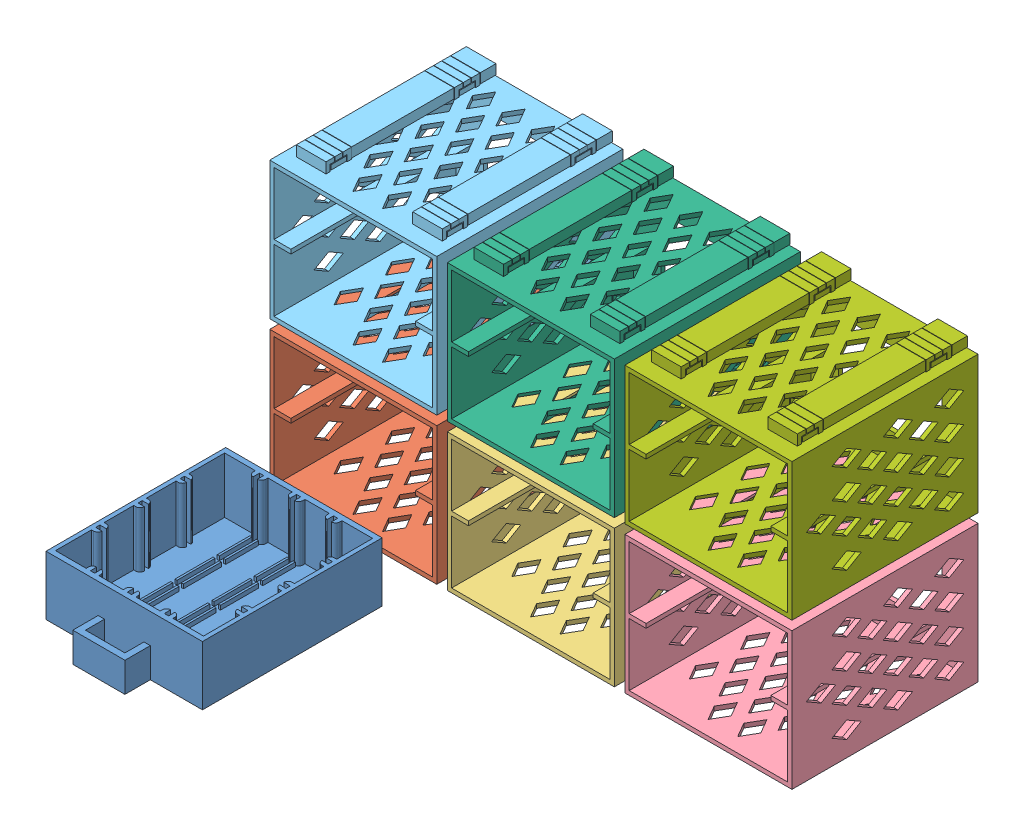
SolidWorks assembly EnsamblajeCajon.SLDASM, configuration Predeterminado (file format 6000). Lengths in mm.
Overall size (247 139.3 208.84).
7 component instances, 7 part files, 17 mates.
Components (placement in the parent):
- Cajon-1: Cajon.SLDPRT [Predeterminado] at (53.1399 3.3054 292.6953) x (-1 0 0) z (0 1 0) size (74 97 28)
- Cabina.EsqInfIzq-1: Cabina.EsqInfIzq.SLDPRT [Predeterminado] at (52.6399 33.8054 138.3519) size (83.3 70 88)
- Cabina.UnionInf-1: Cabina.UnionInf.SLDPRT [Predeterminado] at (136.6399 33.8054 138.3519) size (88.3 70 88)
- Cabina.EsqInfDer-1: Cabina.EsqInfDer.SLDPRT [Predeterminado] at (220.6399 33.8054 138.3519) size (84 70 88)
- Cabina.LateralLzq-1: Cabina.LateralLzq.SLDPRT [Predeterminado] at (52.6399 103.1054 138.3519) size (83.3 74.3 88)
- Cabina.UnionCentral-1: Cabina.UnionCentral.SLDPRT [Predeterminado] at (136.6399 103.1054 138.3519) size (88.3 74.3 88)
- Cabina.LateralDer-1: Cabina.LateralDer.SLDPRT [Predeterminado] at (220.6399 103.1054 138.3519) size (84 74.3 88)
Mates (geometry in assembly coordinates):
- Coincidente1: coincident anti-aligned: plane of Cajon-1 through (53.1399 3.3054 292.6953) normal (0 -1 0); plane of Cabina.EsqInfIzq-1 through (15.1399 3.3054 226.3519) normal (0 1 0)
- Coincidente2: coincident anti-aligned: plane of Cajon-1 through (90.1399 4.9054 335.1953) normal (1 0 0); plane of Cabina.EsqInfIzq-1 through (90.1399 64.3054 226.3519) normal (-1 0 0)
- Coincidente6: coincident aligned: line of Cabina.EsqInfIzq-1 through (13.1399 66.3054 138.3519) axis (1 0 0); line of Cabina.UnionInf-1 through (97.1399 66.3054 138.3519) axis (1 0 0)
- Coincidente7: coincident aligned: line of Cabina.EsqInfIzq-1 through (92.1399 66.3054 226.3519) axis (-1 0 0); line of Cabina.UnionInf-1 through (176.1399 66.3054 226.3519) axis (-1 0 0)
- Coincidente8: coincident anti-aligned: plane of Cabina.EsqInfIzq-1 through (92.1399 66.3054 140.3519) normal (1 0 0); plane of Cabina.UnionInf-1 through (92.1399 33.8054 138.3519) normal (-1 0 0)
- Coincidente9: coincident anti-aligned: plane of Cabina.UnionInf-1 through (176.1399 66.3054 140.3519) normal (1 0 0); plane of Cabina.EsqInfDer-1 through (176.1399 33.8054 138.3519) normal (-1 0 0)
- Coincidente12: coincident aligned: line of Cabina.UnionInf-1 through (176.1399 66.3054 226.3519) axis (-1 0 0); line of Cabina.EsqInfDer-1 through (260.1399 66.3054 226.3519) axis (-1 0 0)
- Coincidente13: coincident aligned: line of Cabina.UnionInf-1 through (97.1399 66.3054 138.3519) axis (1 0 0); line of Cabina.EsqInfDer-1 through (181.1399 66.3054 138.3519) axis (1 0 0)
- Coincidente15: coincident anti-aligned: plane of Cabina.EsqInfIzq-1 through (92.1399 66.3054 140.3519) normal (0 1 0); plane of Cabina.LateralLzq-1 through (52.6399 66.3054 138.3519) normal (0 -1 0)
- Coincidente17: coincident aligned: plane of Cabina.EsqInfIzq-1 through (52.6399 33.8054 226.3519) normal (0 0 1); plane of Cabina.LateralLzq-1 through (52.6399 103.1054 226.3519) normal (0 0 1)
- Coincidente18: coincident aligned: plane of Cabina.EsqInfIzq-1 through (13.1399 66.3054 140.3519) normal (-1 0 0); plane of Cabina.LateralLzq-1 through (13.1399 135.6054 140.3519) normal (-1 0 0)
- Coincidente19: coincident aligned: plane of Cabina.UnionInf-1 through (136.6399 33.8054 226.3519) normal (0 0 1); plane of Cabina.UnionCentral-1 through (136.6399 103.1054 226.3519) normal (0 0 1)
- Coincidente20: coincident aligned: plane of Cabina.UnionInf-1 through (176.1399 66.3054 140.3519) normal (1 0 0); plane of Cabina.UnionCentral-1 through (176.1399 135.6054 140.3519) normal (1 0 0)
- Coincidente21: coincident anti-aligned: plane of Cabina.UnionInf-1 through (176.1399 66.3054 140.3519) normal (0 1 0); plane of Cabina.UnionCentral-1 through (136.6399 66.3054 138.3519) normal (0 -1 0)
- Coincidente22: coincident aligned: plane of Cabina.EsqInfDer-1 through (220.6399 33.8054 226.3519) normal (0 0 1); plane of Cabina.LateralDer-1 through (220.6399 103.1054 226.3519) normal (0 0 1)
- Coincidente23: coincident aligned: plane of Cabina.EsqInfDer-1 through (260.1399 66.3054 140.3519) normal (1 0 0); plane of Cabina.LateralDer-1 through (260.1399 135.6054 140.3519) normal (1 0 0)
- Coincidente24: coincident anti-aligned: plane of Cabina.EsqInfDer-1 through (260.1399 66.3054 140.3519) normal (0 1 0); plane of Cabina.LateralDer-1 through (220.6399 66.3054 138.3519) normal (0 -1 0)
